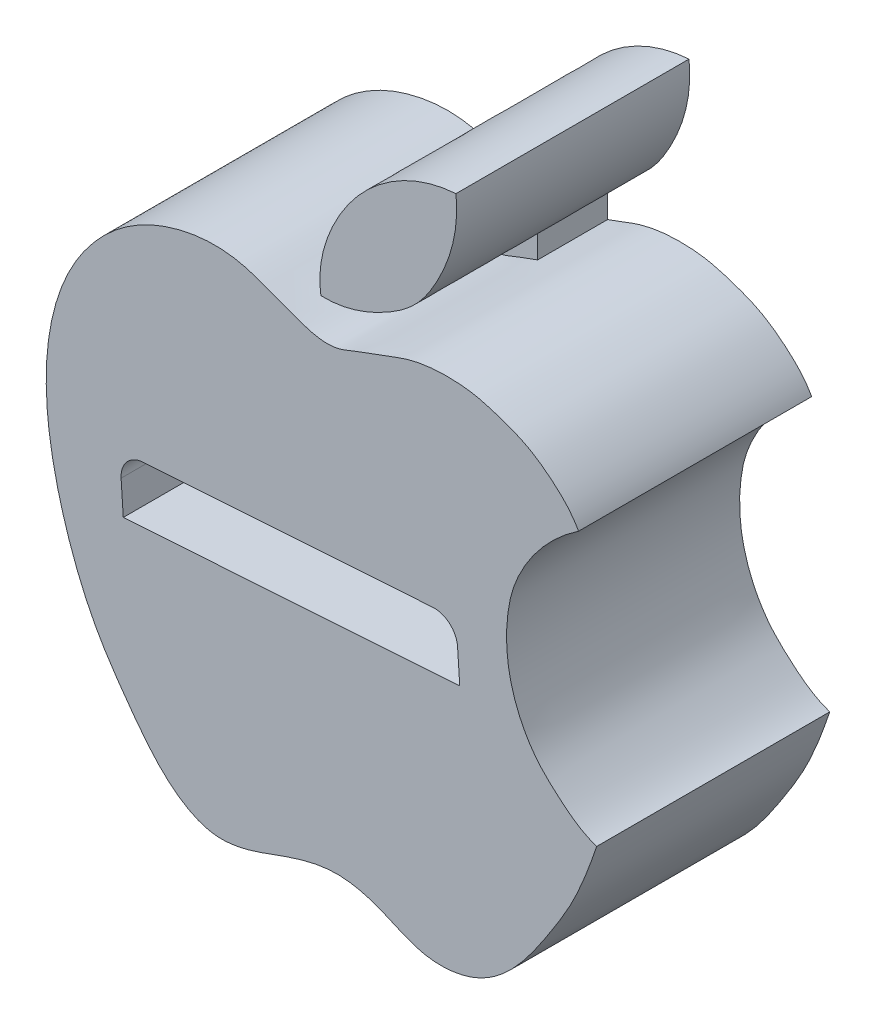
from build123d import *

# Parameters (mm, degrees)
EXTRUDE1_DEPTH          = 200
EXTRUDE1_2_DEPTH        = 200
ESQUISSE1_W             = 40.748163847
ESQUISSE1_H             = 76.564187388
BOSS_EXTRU_1_DEPTH      = 60
ENL_V_MAT_EXTRU_1_DEPTH = 154
CONG_1_R                = 20
ECHELLE2_SCALE          = 0.134


with BuildPart() as part:
    # Sketch1 (on Front Plane) → Extrude1 (new body)
    with BuildSketch(Plane.XY):
        with BuildLine():
            add(Edge.make_bspline(
                [(226.953865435, -62.410219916), (214.160557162, -58.296815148), (197.420660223, -45.402025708), (174.362626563, -23.91504119), (159.289420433, 1.270700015), (149.284507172, 34.736196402), (148.976617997, 65.524633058), (153.502670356, 89.465333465), (167.156025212, 124.637381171), (189.381769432, 149.337992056), (211.446823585, 164.10382234)],
                knots=[0, 0, 0, 0, 0.142487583, 0.223895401, 0.337763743, 0.452510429, 0.595809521, 0.663480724, 0.713070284, 1, 1, 1, 1], degree=3))
            add(Edge.make_bspline(
                [(211.446823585, 164.10382234), (205.718084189, 174.543286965), (191.090387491, 189.396737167), (167.565919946, 206.226642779), (144.445697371, 214.790733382), (123.141665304, 221.284257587), (95.203755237, 223.788055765), (67.923170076, 220.877316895), (44.044571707, 210.467682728), (27.965546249, 205.494568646), (14.583745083, 199.579906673), (-1.306446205, 194.155005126), (-19.607173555, 197.197282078), (-39.010493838, 204.787626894), (-56.008561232, 211.008724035), (-78.189599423, 219.302234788), (-99.520404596, 221.557411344), (-120.117417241, 219.26114439), (-136.431361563, 215.709151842), (-160.379573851, 207.260765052), (-186.453412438, 190.697233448), (-207.683324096, 168.023016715), (-226.121236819, 140.745438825), (-237.279525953, 112.20276694), (-242.646552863, 85.849743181), (-245.857103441, 59.783822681), (-245.606568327, 33.031512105), (-240.952500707, -6.132447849), (-228.934338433, -56.594764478), (-206.77372597, -112.262430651), (-176.787052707, -154.889935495), (-155.043883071, -184.142089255), (-132.534419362, -206.295272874), (-103.735654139, -219.967215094), (-75.295891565, -216.348286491), (-40.6268219, -203.473662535), (-1.69383299, -189.796906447), (42.501839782, -200.779465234), (78.5927639, -221.135229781), (126.78778497, -215.828036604), (161.496633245, -184.661781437), (185.047572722, -149.695700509), (209.699992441, -110.543887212), (220.863503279, -80.325618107), (226.953865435, -62.410219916)],
                knots=[0, 0, 0, 0, 0.02675233, 0.046733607, 0.064996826, 0.082321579, 0.097011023, 0.128365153, 0.142995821, 0.155885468, 0.166410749, 0.176219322, 0.19341538, 0.206706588, 0.223677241, 0.234360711, 0.260338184, 0.27113645, 0.281276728, 0.298098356, 0.328470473, 0.350114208, 0.368075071, 0.402839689, 0.418566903, 0.42895912, 0.462303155, 0.478812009, 0.518263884, 0.579602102, 0.612960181, 0.636073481, 0.662145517, 0.684015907, 0.705483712, 0.724700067, 0.768618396, 0.794907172, 0.825219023, 0.86132878, 0.89548215, 0.92755104, 0.9570306, 1, 1, 1, 1], degree=3))
        make_face()
    extrude(amount=EXTRUDE1_DEPTH)



with BuildPart() as body_2:
    # Sketch1 (on Front Plane) → Extrude1 2 (new body)
    with BuildSketch(Plane.XY):
        with BuildLine():
            add(Edge.make_bspline(
                [(-9.734308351, 228.563873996), (-12.775123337, 248.990819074), (-2.741420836, 287.076817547), (36.494968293, 340.34151019), (79.078946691, 360.521001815), (106.161164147, 362.289419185)],
                knots=[0, 0, 0, 0, 0.313870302, 0.584944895, 1, 1, 1, 1], degree=3))
            add(Edge.make_bspline(
                [(-9.734308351, 228.563873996), (8.744058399, 227.853349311), (38.866744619, 237.868634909), (71.785470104, 260.235437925), (98.56914319, 300.134011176), (109.136088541, 334.764377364), (106.161164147, 362.289419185)],
                knots=[0, 0, 0, 0, 0.278565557, 0.466932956, 0.591977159, 1, 1, 1, 1], degree=3))
        make_face()
    extrude(amount=EXTRUDE1_2_DEPTH)


with BuildPart() as part_1:
    add(part.part)

    add(body_2.part)  # Boss.-Extru.1 merges body 2
    # Esquisse1 → Boss.-Extru.1 (add)
    with BuildSketch(Plane(origin=(0, 0, 0), x_dir=(-1, 0, 0), z_dir=(0, 0, -1))):
        with Locations((-15.927615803, 214.461311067)):
            Rectangle(ESQUISSE1_W, ESQUISSE1_H)
    extrude(amount=-BOSS_EXTRU_1_DEPTH)

    # Esquisse2 → Enl_v. mat.-Extru.1 (cut)
    with BuildSketch(Plane.XY.offset(200)):
        Polygon((-182.490637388, 27.135844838), (106.241010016, 46.296263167), (109.439593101, -1.903736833), (-179.292054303, -21.064155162), align=None)
    extrude(amount=-ENL_V_MAT_EXTRU_1_DEPTH, mode=Mode.SUBTRACT)

    # Cong_1
    cong_1_edges = [part_1.edges().sort_by_distance(p)[0] for p in [
        (-182.490637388, 27.135844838, 123),
        (106.241010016, 46.296263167, 123),
    ]]
    fillet(cong_1_edges, radius=CONG_1_R)


with BuildPart() as part_2:
    # Echelle2: scaled about (0, 0, 0)
    add(part_1.part.scale(ECHELLE2_SCALE))


solid = part_2.part
